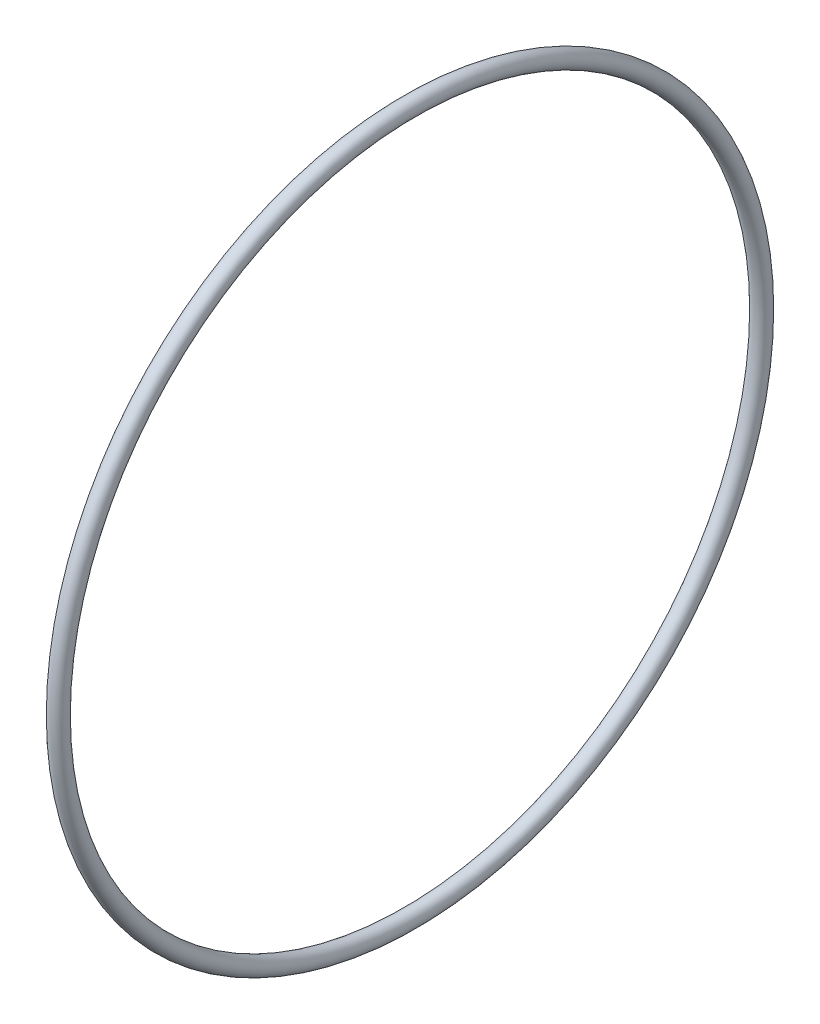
from build123d import *

# Parameters (mm, degrees)
SKETCH1_R = 1.7653


with BuildPart() as part:
    # Sketch1 → Base-Revolve (revolve)
    with BuildSketch(Plane.XY, mode=Mode.PRIVATE) as base_revolve_sk:
        with Locations((0, 72.9996)):
            Circle(SKETCH1_R)
    revolve(base_revolve_sk.sketch.rotate(Axis((0, 0, 0), (1, 0, 0)), 90), axis=Axis((0, 0, 0), (1, 0, 0)))


solid = part.part
